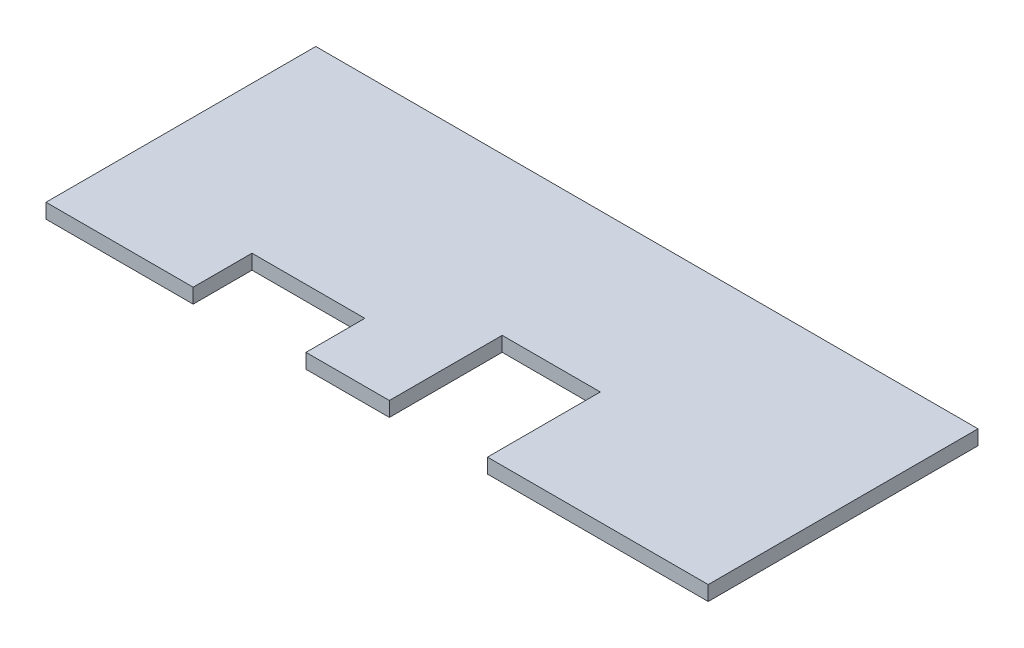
ISO-10303-21;
HEADER;
FILE_DESCRIPTION(('STEP AP214'),'2;1');
FILE_NAME('part.step','',(''),(''),'','','');
FILE_SCHEMA(('AUTOMOTIVE_DESIGN { 1 0 10303 214 1 1 1 1 }'));
ENDSEC;
DATA;
#1=APPLICATION_CONTEXT('core data for automotive mechanical design processes');
#2=APPLICATION_PROTOCOL_DEFINITION('international standard','automotive_design',2000,#1);
#3=PRODUCT_CONTEXT('',#1,'mechanical');
#4=PRODUCT('Part','Part','',(#3));
#5=PRODUCT_RELATED_PRODUCT_CATEGORY('part','',(#4));
#6=PRODUCT_DEFINITION_FORMATION('','',#4);
#7=PRODUCT_DEFINITION_CONTEXT('part definition',#1,'design');
#8=PRODUCT_DEFINITION('design','',#6,#7);
#9=PRODUCT_DEFINITION_SHAPE('','',#8);
#10=(LENGTH_UNIT() NAMED_UNIT(*) SI_UNIT(.MILLI.,.METRE.));
#11=(NAMED_UNIT(*) PLANE_ANGLE_UNIT() SI_UNIT($,.RADIAN.));
#12=(NAMED_UNIT(*) SI_UNIT($,.STERADIAN.) SOLID_ANGLE_UNIT());
#13=UNCERTAINTY_MEASURE_WITH_UNIT(LENGTH_MEASURE(1.E-05),#10,'distance_accuracy_value','');
#14=(GEOMETRIC_REPRESENTATION_CONTEXT(3) GLOBAL_UNCERTAINTY_ASSIGNED_CONTEXT((#13)) GLOBAL_UNIT_ASSIGNED_CONTEXT((#10,
#11,#12)) REPRESENTATION_CONTEXT('',''));
#15=CARTESIAN_POINT('',(0.,0.,0.));
#16=DIRECTION('',(0.,0.,1.));
#17=DIRECTION('',(1.,0.,0.));
#18=AXIS2_PLACEMENT_3D('',#15,#16,#17);
#19=CARTESIAN_POINT('',(22.5,3.,0.));
#20=DIRECTION('',(-1.,0.,0.));
#21=DIRECTION('',(0.,0.,1.));
#22=AXIS2_PLACEMENT_3D('',#19,#20,#21);
#23=PLANE('',#22);
#24=DIRECTION('',(0.,0.,-1.));
#25=VECTOR('',#24,1.);
#26=CARTESIAN_POINT('',(22.5,0.,0.));
#27=LINE('',#26,#25);
#28=CARTESIAN_POINT('',(22.5,0.,27.5));
#29=VERTEX_POINT('',#28);
#30=CARTESIAN_POINT('',(22.5,0.,4.5));
#31=VERTEX_POINT('',#30);
#32=EDGE_CURVE('E154',#29,#31,#27,.T.);
#33=ORIENTED_EDGE('',*,*,#32,.F.);
#34=DIRECTION('',(0.,-1.,0.));
#35=VECTOR('',#34,1.);
#36=CARTESIAN_POINT('',(22.5,3.,27.5));
#37=LINE('',#36,#35);
#38=CARTESIAN_POINT('',(22.5,3.,27.5));
#39=VERTEX_POINT('',#38);
#40=EDGE_CURVE('E11',#39,#29,#37,.T.);
#41=ORIENTED_EDGE('',*,*,#40,.F.);
#42=DIRECTION('',(0.,0.,-1.));
#43=VECTOR('',#42,1.);
#44=CARTESIAN_POINT('',(22.5,3.,0.));
#45=LINE('',#44,#43);
#46=CARTESIAN_POINT('',(22.5,3.,4.5));
#47=VERTEX_POINT('',#46);
#48=EDGE_CURVE('E183',#39,#47,#45,.T.);
#49=ORIENTED_EDGE('',*,*,#48,.T.);
#50=DIRECTION('',(0.,-1.,0.));
#51=VECTOR('',#50,1.);
#52=CARTESIAN_POINT('',(22.5,3.,4.5));
#53=LINE('',#52,#51);
#54=EDGE_CURVE('E99',#47,#31,#53,.T.);
#55=ORIENTED_EDGE('',*,*,#54,.T.);
#56=EDGE_LOOP('',(#33,#41,#49,#55));
#57=FACE_BOUND('',#56,.T.);
#58=ADVANCED_FACE('F36',(#57),#23,.T.);
#59=CARTESIAN_POINT('',(0.,3.,27.5));
#60=DIRECTION('',(0.,0.,-1.));
#61=DIRECTION('',(-1.,0.,0.));
#62=AXIS2_PLACEMENT_3D('',#59,#60,#61);
#63=PLANE('',#62);
#64=DIRECTION('',(1.,0.,0.));
#65=VECTOR('',#64,1.);
#66=CARTESIAN_POINT('',(0.,0.,27.5));
#67=LINE('',#66,#65);
#68=CARTESIAN_POINT('',(67.5,0.,27.5));
#69=VERTEX_POINT('',#68);
#70=EDGE_CURVE('E157',#29,#69,#67,.T.);
#71=ORIENTED_EDGE('',*,*,#70,.T.);
#72=DIRECTION('',(0.,-1.,0.));
#73=VECTOR('',#72,1.);
#74=CARTESIAN_POINT('',(67.5,3.,27.5));
#75=LINE('',#74,#73);
#76=CARTESIAN_POINT('',(67.5,3.,27.5));
#77=VERTEX_POINT('',#76);
#78=EDGE_CURVE('E44',#77,#69,#75,.T.);
#79=ORIENTED_EDGE('',*,*,#78,.F.);
#80=DIRECTION('',(1.,0.,0.));
#81=VECTOR('',#80,1.);
#82=CARTESIAN_POINT('',(0.,3.,27.5));
#83=LINE('',#82,#81);
#84=EDGE_CURVE('E140',#39,#77,#83,.T.);
#85=ORIENTED_EDGE('',*,*,#84,.F.);
#86=ORIENTED_EDGE('',*,*,#40,.T.);
#87=EDGE_LOOP('',(#71,#79,#85,#86));
#88=FACE_BOUND('',#87,.T.);
#89=ADVANCED_FACE('F241',(#88),#63,.F.);
#90=CARTESIAN_POINT('',(67.5,3.,0.));
#91=DIRECTION('',(-1.,0.,0.));
#92=DIRECTION('',(0.,0.,1.));
#93=AXIS2_PLACEMENT_3D('',#90,#91,#92);
#94=PLANE('',#93);
#95=DIRECTION('',(0.,0.,-1.));
#96=VECTOR('',#95,1.);
#97=CARTESIAN_POINT('',(67.5,0.,0.));
#98=LINE('',#97,#96);
#99=CARTESIAN_POINT('',(67.5,0.,-27.5));
#100=VERTEX_POINT('',#99);
#101=EDGE_CURVE('E159',#69,#100,#98,.T.);
#102=ORIENTED_EDGE('',*,*,#101,.T.);
#103=DIRECTION('',(0.,-1.,0.));
#104=VECTOR('',#103,1.);
#105=CARTESIAN_POINT('',(67.5,3.,-27.5));
#106=LINE('',#105,#104);
#107=CARTESIAN_POINT('',(67.5,3.,-27.5));
#108=VERTEX_POINT('',#107);
#109=EDGE_CURVE('E197',#108,#100,#106,.T.);
#110=ORIENTED_EDGE('',*,*,#109,.F.);
#111=DIRECTION('',(0.,0.,-1.));
#112=VECTOR('',#111,1.);
#113=CARTESIAN_POINT('',(67.5,3.,0.));
#114=LINE('',#113,#112);
#115=EDGE_CURVE('E205',#77,#108,#114,.T.);
#116=ORIENTED_EDGE('',*,*,#115,.F.);
#117=ORIENTED_EDGE('',*,*,#78,.T.);
#118=EDGE_LOOP('',(#102,#110,#116,#117));
#119=FACE_BOUND('',#118,.T.);
#120=ADVANCED_FACE('F203',(#119),#94,.F.);
#121=CARTESIAN_POINT('',(0.,3.,-27.5));
#122=DIRECTION('',(0.,0.,-1.));
#123=DIRECTION('',(-1.,0.,0.));
#124=AXIS2_PLACEMENT_3D('',#121,#122,#123);
#125=PLANE('',#124);
#126=DIRECTION('',(1.,0.,0.));
#127=VECTOR('',#126,1.);
#128=CARTESIAN_POINT('',(0.,0.,-27.5));
#129=LINE('',#128,#127);
#130=CARTESIAN_POINT('',(-67.5,0.,-27.5));
#131=VERTEX_POINT('',#130);
#132=EDGE_CURVE('E162',#131,#100,#129,.T.);
#133=ORIENTED_EDGE('',*,*,#132,.F.);
#134=DIRECTION('',(0.,-1.,0.));
#135=VECTOR('',#134,1.);
#136=CARTESIAN_POINT('',(-67.5,3.,-27.5));
#137=LINE('',#136,#135);
#138=CARTESIAN_POINT('',(-67.5,3.,-27.5));
#139=VERTEX_POINT('',#138);
#140=EDGE_CURVE('E195',#139,#131,#137,.T.);
#141=ORIENTED_EDGE('',*,*,#140,.F.);
#142=DIRECTION('',(1.,0.,0.));
#143=VECTOR('',#142,1.);
#144=CARTESIAN_POINT('',(0.,3.,-27.5));
#145=LINE('',#144,#143);
#146=EDGE_CURVE('E217',#139,#108,#145,.T.);
#147=ORIENTED_EDGE('',*,*,#146,.T.);
#148=ORIENTED_EDGE('',*,*,#109,.T.);
#149=EDGE_LOOP('',(#133,#141,#147,#148));
#150=FACE_BOUND('',#149,.T.);
#151=ADVANCED_FACE('F214',(#150),#125,.T.);
#152=CARTESIAN_POINT('',(-67.5,3.,0.));
#153=DIRECTION('',(-1.,0.,0.));
#154=DIRECTION('',(0.,0.,1.));
#155=AXIS2_PLACEMENT_3D('',#152,#153,#154);
#156=PLANE('',#155);
#157=DIRECTION('',(0.,0.,-1.));
#158=VECTOR('',#157,1.);
#159=CARTESIAN_POINT('',(-67.5,0.,0.));
#160=LINE('',#159,#158);
#161=CARTESIAN_POINT('',(-67.5,0.,27.5));
#162=VERTEX_POINT('',#161);
#163=EDGE_CURVE('E165',#162,#131,#160,.T.);
#164=ORIENTED_EDGE('',*,*,#163,.F.);
#165=DIRECTION('',(0.,-1.,0.));
#166=VECTOR('',#165,1.);
#167=CARTESIAN_POINT('',(-67.5,3.,27.5));
#168=LINE('',#167,#166);
#169=CARTESIAN_POINT('',(-67.5,3.,27.5));
#170=VERTEX_POINT('',#169);
#171=EDGE_CURVE('E193',#170,#162,#168,.T.);
#172=ORIENTED_EDGE('',*,*,#171,.F.);
#173=DIRECTION('',(0.,0.,-1.));
#174=VECTOR('',#173,1.);
#175=CARTESIAN_POINT('',(-67.5,3.,0.));
#176=LINE('',#175,#174);
#177=EDGE_CURVE('E220',#170,#139,#176,.T.);
#178=ORIENTED_EDGE('',*,*,#177,.T.);
#179=ORIENTED_EDGE('',*,*,#140,.T.);
#180=EDGE_LOOP('',(#164,#172,#178,#179));
#181=FACE_BOUND('',#180,.T.);
#182=ADVANCED_FACE('F269',(#181),#156,.T.);
#183=CARTESIAN_POINT('',(0.,3.,27.5));
#184=DIRECTION('',(0.,0.,-1.));
#185=DIRECTION('',(-1.,0.,0.));
#186=AXIS2_PLACEMENT_3D('',#183,#184,#185);
#187=PLANE('',#186);
#188=DIRECTION('',(1.,0.,0.));
#189=VECTOR('',#188,1.);
#190=CARTESIAN_POINT('',(0.,0.,27.5));
#191=LINE('',#190,#189);
#192=CARTESIAN_POINT('',(-37.5,0.,27.5));
#193=VERTEX_POINT('',#192);
#194=EDGE_CURVE('E168',#162,#193,#191,.T.);
#195=ORIENTED_EDGE('',*,*,#194,.T.);
#196=DIRECTION('',(0.,-1.,0.));
#197=VECTOR('',#196,1.);
#198=CARTESIAN_POINT('',(-37.5,3.,27.5));
#199=LINE('',#198,#197);
#200=CARTESIAN_POINT('',(-37.5,3.,27.5));
#201=VERTEX_POINT('',#200);
#202=EDGE_CURVE('E191',#201,#193,#199,.T.);
#203=ORIENTED_EDGE('',*,*,#202,.F.);
#204=DIRECTION('',(1.,0.,0.));
#205=VECTOR('',#204,1.);
#206=CARTESIAN_POINT('',(0.,3.,27.5));
#207=LINE('',#206,#205);
#208=EDGE_CURVE('E222',#170,#201,#207,.T.);
#209=ORIENTED_EDGE('',*,*,#208,.F.);
#210=ORIENTED_EDGE('',*,*,#171,.T.);
#211=EDGE_LOOP('',(#195,#203,#209,#210));
#212=FACE_BOUND('',#211,.T.);
#213=ADVANCED_FACE('F265',(#212),#187,.F.);
#214=CARTESIAN_POINT('',(-37.5,3.,0.));
#215=DIRECTION('',(1.,0.,0.));
#216=DIRECTION('',(0.,0.,-1.));
#217=AXIS2_PLACEMENT_3D('',#214,#215,#216);
#218=PLANE('',#217);
#219=DIRECTION('',(0.,0.,1.));
#220=VECTOR('',#219,1.);
#221=CARTESIAN_POINT('',(-37.5,0.,0.));
#222=LINE('',#221,#220);
#223=CARTESIAN_POINT('',(-37.5,0.,15.5));
#224=VERTEX_POINT('',#223);
#225=EDGE_CURVE('E171',#224,#193,#222,.T.);
#226=ORIENTED_EDGE('',*,*,#225,.F.);
#227=DIRECTION('',(0.,-1.,0.));
#228=VECTOR('',#227,1.);
#229=CARTESIAN_POINT('',(-37.5,3.,15.5));
#230=LINE('',#229,#228);
#231=CARTESIAN_POINT('',(-37.5,3.,15.5));
#232=VERTEX_POINT('',#231);
#233=EDGE_CURVE('E189',#232,#224,#230,.T.);
#234=ORIENTED_EDGE('',*,*,#233,.F.);
#235=DIRECTION('',(0.,0.,1.));
#236=VECTOR('',#235,1.);
#237=CARTESIAN_POINT('',(-37.5,3.,0.));
#238=LINE('',#237,#236);
#239=EDGE_CURVE('E227',#232,#201,#238,.T.);
#240=ORIENTED_EDGE('',*,*,#239,.T.);
#241=ORIENTED_EDGE('',*,*,#202,.T.);
#242=EDGE_LOOP('',(#226,#234,#240,#241));
#243=FACE_BOUND('',#242,.T.);
#244=ADVANCED_FACE('F259',(#243),#218,.T.);
#245=CARTESIAN_POINT('',(0.,3.,15.5));
#246=DIRECTION('',(0.,0.,-1.));
#247=DIRECTION('',(-1.,0.,0.));
#248=AXIS2_PLACEMENT_3D('',#245,#246,#247);
#249=PLANE('',#248);
#250=DIRECTION('',(1.,0.,0.));
#251=VECTOR('',#250,1.);
#252=CARTESIAN_POINT('',(0.,0.,15.5));
#253=LINE('',#252,#251);
#254=CARTESIAN_POINT('',(-14.5,0.,15.5));
#255=VERTEX_POINT('',#254);
#256=EDGE_CURVE('E174',#224,#255,#253,.T.);
#257=ORIENTED_EDGE('',*,*,#256,.T.);
#258=DIRECTION('',(0.,-1.,0.));
#259=VECTOR('',#258,1.);
#260=CARTESIAN_POINT('',(-14.5,3.,15.5));
#261=LINE('',#260,#259);
#262=CARTESIAN_POINT('',(-14.5,3.,15.5));
#263=VERTEX_POINT('',#262);
#264=EDGE_CURVE('E187',#263,#255,#261,.T.);
#265=ORIENTED_EDGE('',*,*,#264,.F.);
#266=DIRECTION('',(1.,0.,0.));
#267=VECTOR('',#266,1.);
#268=CARTESIAN_POINT('',(0.,3.,15.5));
#269=LINE('',#268,#267);
#270=EDGE_CURVE('E229',#232,#263,#269,.T.);
#271=ORIENTED_EDGE('',*,*,#270,.F.);
#272=ORIENTED_EDGE('',*,*,#233,.T.);
#273=EDGE_LOOP('',(#257,#265,#271,#272));
#274=FACE_BOUND('',#273,.T.);
#275=ADVANCED_FACE('F255',(#274),#249,.F.);
#276=CARTESIAN_POINT('',(-14.5,3.,0.));
#277=DIRECTION('',(-1.,0.,0.));
#278=DIRECTION('',(0.,0.,1.));
#279=AXIS2_PLACEMENT_3D('',#276,#277,#278);
#280=PLANE('',#279);
#281=DIRECTION('',(0.,0.,-1.));
#282=VECTOR('',#281,1.);
#283=CARTESIAN_POINT('',(-14.5,0.,0.));
#284=LINE('',#283,#282);
#285=CARTESIAN_POINT('',(-14.5,0.,27.5));
#286=VERTEX_POINT('',#285);
#287=EDGE_CURVE('E177',#286,#255,#284,.T.);
#288=ORIENTED_EDGE('',*,*,#287,.F.);
#289=DIRECTION('',(0.,-1.,0.));
#290=VECTOR('',#289,1.);
#291=CARTESIAN_POINT('',(-14.5,3.,27.5));
#292=LINE('',#291,#290);
#293=CARTESIAN_POINT('',(-14.5,3.,27.5));
#294=VERTEX_POINT('',#293);
#295=EDGE_CURVE('E145',#294,#286,#292,.T.);
#296=ORIENTED_EDGE('',*,*,#295,.F.);
#297=DIRECTION('',(0.,0.,-1.));
#298=VECTOR('',#297,1.);
#299=CARTESIAN_POINT('',(-14.5,3.,0.));
#300=LINE('',#299,#298);
#301=EDGE_CURVE('E137',#294,#263,#300,.T.);
#302=ORIENTED_EDGE('',*,*,#301,.T.);
#303=ORIENTED_EDGE('',*,*,#264,.T.);
#304=EDGE_LOOP('',(#288,#296,#302,#303));
#305=FACE_BOUND('',#304,.T.);
#306=ADVANCED_FACE('F235',(#305),#280,.T.);
#307=CARTESIAN_POINT('',(2.49999999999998,0.,27.5));
#308=VERTEX_POINT('',#307);
#309=EDGE_CURVE('E144',#286,#308,#67,.T.);
#310=ORIENTED_EDGE('',*,*,#309,.T.);
#311=DIRECTION('',(0.,-1.,0.));
#312=VECTOR('',#311,1.);
#313=CARTESIAN_POINT('',(2.49999999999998,3.,27.5));
#314=LINE('',#313,#312);
#315=CARTESIAN_POINT('',(2.49999999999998,3.,27.5));
#316=VERTEX_POINT('',#315);
#317=EDGE_CURVE('E141',#316,#308,#314,.T.);
#318=ORIENTED_EDGE('',*,*,#317,.F.);
#319=EDGE_CURVE('E131',#294,#316,#83,.T.);
#320=ORIENTED_EDGE('',*,*,#319,.F.);
#321=ORIENTED_EDGE('',*,*,#295,.T.);
#322=EDGE_LOOP('',(#310,#318,#320,#321));
#323=FACE_BOUND('',#322,.T.);
#324=ADVANCED_FACE('F142',(#323),#63,.F.);
#325=CARTESIAN_POINT('',(2.49999999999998,3.,0.));
#326=DIRECTION('',(-1.,0.,0.));
#327=DIRECTION('',(0.,0.,1.));
#328=AXIS2_PLACEMENT_3D('',#325,#326,#327);
#329=PLANE('',#328);
#330=DIRECTION('',(0.,0.,-1.));
#331=VECTOR('',#330,1.);
#332=CARTESIAN_POINT('',(2.49999999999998,0.,0.));
#333=LINE('',#332,#331);
#334=CARTESIAN_POINT('',(2.49999999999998,0.,4.5));
#335=VERTEX_POINT('',#334);
#336=EDGE_CURVE('E92',#308,#335,#333,.T.);
#337=ORIENTED_EDGE('',*,*,#336,.T.);
#338=DIRECTION('',(0.,-1.,0.));
#339=VECTOR('',#338,1.);
#340=CARTESIAN_POINT('',(2.49999999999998,3.,4.5));
#341=LINE('',#340,#339);
#342=CARTESIAN_POINT('',(2.49999999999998,3.,4.5));
#343=VERTEX_POINT('',#342);
#344=EDGE_CURVE('E146',#343,#335,#341,.T.);
#345=ORIENTED_EDGE('',*,*,#344,.F.);
#346=DIRECTION('',(0.,0.,-1.));
#347=VECTOR('',#346,1.);
#348=CARTESIAN_POINT('',(2.49999999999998,3.,0.));
#349=LINE('',#348,#347);
#350=EDGE_CURVE('E135',#316,#343,#349,.T.);
#351=ORIENTED_EDGE('',*,*,#350,.F.);
#352=ORIENTED_EDGE('',*,*,#317,.T.);
#353=EDGE_LOOP('',(#337,#345,#351,#352));
#354=FACE_BOUND('',#353,.T.);
#355=ADVANCED_FACE('F148',(#354),#329,.F.);
#356=CARTESIAN_POINT('',(0.,3.,4.5));
#357=DIRECTION('',(0.,0.,-1.));
#358=DIRECTION('',(-1.,0.,0.));
#359=AXIS2_PLACEMENT_3D('',#356,#357,#358);
#360=PLANE('',#359);
#361=DIRECTION('',(1.,0.,0.));
#362=VECTOR('',#361,1.);
#363=CARTESIAN_POINT('',(0.,0.,4.5));
#364=LINE('',#363,#362);
#365=EDGE_CURVE('E181',#335,#31,#364,.T.);
#366=ORIENTED_EDGE('',*,*,#365,.T.);
#367=ORIENTED_EDGE('',*,*,#54,.F.);
#368=DIRECTION('',(1.,0.,0.));
#369=VECTOR('',#368,1.);
#370=CARTESIAN_POINT('',(0.,3.,4.5));
#371=LINE('',#370,#369);
#372=EDGE_CURVE('E52',#343,#47,#371,.T.);
#373=ORIENTED_EDGE('',*,*,#372,.F.);
#374=ORIENTED_EDGE('',*,*,#344,.T.);
#375=EDGE_LOOP('',(#366,#367,#373,#374));
#376=FACE_BOUND('',#375,.T.);
#377=ADVANCED_FACE('F239',(#376),#360,.F.);
#378=CARTESIAN_POINT('',(0.,3.,0.));
#379=DIRECTION('',(0.,1.,0.));
#380=DIRECTION('',(0.,0.,1.));
#381=AXIS2_PLACEMENT_3D('',#378,#379,#380);
#382=PLANE('',#381);
#383=ORIENTED_EDGE('',*,*,#48,.F.);
#384=ORIENTED_EDGE('',*,*,#84,.T.);
#385=ORIENTED_EDGE('',*,*,#115,.T.);
#386=ORIENTED_EDGE('',*,*,#146,.F.);
#387=ORIENTED_EDGE('',*,*,#177,.F.);
#388=ORIENTED_EDGE('',*,*,#208,.T.);
#389=ORIENTED_EDGE('',*,*,#239,.F.);
#390=ORIENTED_EDGE('',*,*,#270,.T.);
#391=ORIENTED_EDGE('',*,*,#301,.F.);
#392=ORIENTED_EDGE('',*,*,#319,.T.);
#393=ORIENTED_EDGE('',*,*,#350,.T.);
#394=ORIENTED_EDGE('',*,*,#372,.T.);
#395=EDGE_LOOP('',(#383,#384,#385,#386,#387,#388,#389,#390,#391,#392,#393,#394));
#396=FACE_BOUND('',#395,.T.);
#397=ADVANCED_FACE('F133',(#396),#382,.T.);
#398=CARTESIAN_POINT('',(0.,0.,0.));
#399=DIRECTION('',(0.,1.,0.));
#400=DIRECTION('',(0.,0.,1.));
#401=AXIS2_PLACEMENT_3D('',#398,#399,#400);
#402=PLANE('',#401);
#403=ORIENTED_EDGE('',*,*,#32,.T.);
#404=ORIENTED_EDGE('',*,*,#365,.F.);
#405=ORIENTED_EDGE('',*,*,#336,.F.);
#406=ORIENTED_EDGE('',*,*,#309,.F.);
#407=ORIENTED_EDGE('',*,*,#287,.T.);
#408=ORIENTED_EDGE('',*,*,#256,.F.);
#409=ORIENTED_EDGE('',*,*,#225,.T.);
#410=ORIENTED_EDGE('',*,*,#194,.F.);
#411=ORIENTED_EDGE('',*,*,#163,.T.);
#412=ORIENTED_EDGE('',*,*,#132,.T.);
#413=ORIENTED_EDGE('',*,*,#101,.F.);
#414=ORIENTED_EDGE('',*,*,#70,.F.);
#415=EDGE_LOOP('',(#403,#404,#405,#406,#407,#408,#409,#410,#411,#412,#413,#414));
#416=FACE_BOUND('',#415,.T.);
#417=ADVANCED_FACE('F209',(#416),#402,.F.);
#418=CLOSED_SHELL('',(#58,#89,#120,#151,#182,#213,#244,#275,#306,#324,#355,#377,#397,#417));
#419=MANIFOLD_SOLID_BREP('B2',#418);
#420=ADVANCED_BREP_SHAPE_REPRESENTATION('',(#18,#419),#14);
#421=SHAPE_DEFINITION_REPRESENTATION(#9,#420);
ENDSEC;
END-ISO-10303-21;
